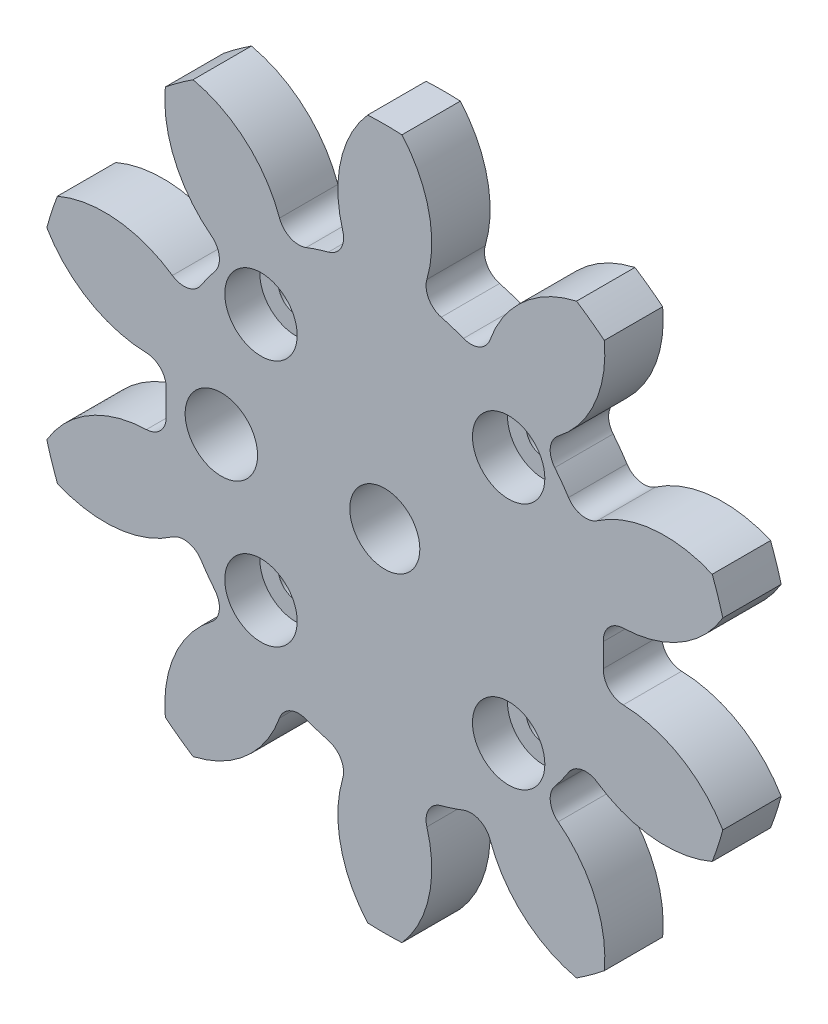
from build123d import *

# Parameters (mm, degrees)
BOSS_EXTRU_1_DEPTH                 = 5
CONG_1_R                           = 1.75
R_P_TITION_CIRCULAIRE4_COUNT       = 10
CONG_1_OF_R_P_TITION_CIRCULAIRE4_R = 1.75
ESQUISSE6_R                        = 3
ENL_V_MAT_EXTRU_1_DEPTH            = 10
ESQUISSE8_R                        = 1.5
ESQUISSE8_R_2                      = 3.1
ENL_V_MAT_EXTRU_3_DEPTH            = 42.990234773
ESQUISSE9_R                        = 3.1
ENL_V_MAT_EXTRU_4_DEPTH            = 3


with BuildPart() as part:
    # Esquisse3 → Boss.-Extru.1 (new body)
    with BuildSketch(Plane.XY):
        with BuildLine():
            Line((-5.794068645, 17.832309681), (0, 0))
            Line((0, 0), (5.794068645, 17.832309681))
            ThreePointArc((5.794068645, 17.832309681), (4.357814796, 18.236555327), (2.893965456, 18.525319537))
            ThreePointArc((2.893965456, 18.525319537), (3.941898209, 24.464041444), (1.468694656, 29.964027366))
            ThreePointArc((1.468694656, 29.964027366), (0, 30), (-1.468694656, 29.964027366))
            ThreePointArc((-1.468694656, 29.964027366), (-3.941898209, 24.464041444), (-2.893965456, 18.525319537))
            ThreePointArc((-2.893965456, 18.525319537), (-4.357814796, 18.236555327), (-5.794068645, 17.832309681))
        make_face()
    boss_extru_1 = extrude(amount=BOSS_EXTRU_1_DEPTH)

    # Cong_1
    cong_1_edges = [part.edges().sort_by_distance(p)[0] for p in [
        (-2.893965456, 18.525319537, 2.5),
        (2.893965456, 18.525319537, 2.5),
    ]]
    fillet(cong_1_edges, radius=CONG_1_R)

    # R_p_tition circulaire4: Boss.-Extru.1 ×10 about axis
    r_p_tition_circulaire4_axis = Axis((0, 0, 0), (0, 0, 1))
    for i in range(1, R_P_TITION_CIRCULAIRE4_COUNT):
        add(boss_extru_1.rotate(r_p_tition_circulaire4_axis, i * 360 / R_P_TITION_CIRCULAIRE4_COUNT))

    # Cong_1 of R_p_tition circulaire4
    cong_1_of_r_p_tition_circulaire4_edges = [part.edges().sort_by_distance(p)[0] for p in [
        (-13.230176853, 13.286268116, 2.5),
        (-8.547642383, 16.688328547, 2.5),
        (-18.512910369, 2.972313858, 2.5),
        (-16.724341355, 8.476963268, 2.5),
        (-16.724341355, -8.476963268, 2.5),
        (-18.512910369, -2.972313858, 2.5),
        (-8.547642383, -16.688328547, 2.5),
        (-13.230176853, -13.286268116, 2.5),
        (2.893965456, -18.525319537, 2.5),
        (-2.893965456, -18.525319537, 2.5),
        (13.230176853, -13.286268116, 2.5),
        (8.547642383, -16.688328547, 2.5),
        (18.512910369, -2.972313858, 2.5),
        (16.724341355, -8.476963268, 2.5),
        (16.724341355, 8.476963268, 2.5),
        (18.512910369, 2.972313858, 2.5),
        (8.547642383, 16.688328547, 2.5),
        (13.230176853, 13.286268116, 2.5),
    ]]
    fillet(cong_1_of_r_p_tition_circulaire4_edges, radius=CONG_1_OF_R_P_TITION_CIRCULAIRE4_R)

    # Esquisse6 → Enl_v. mat.-Extru.1 (cut)
    with BuildSketch(Plane.XY.offset(5)):
        Circle(ESQUISSE6_R)
    extrude(amount=-ENL_V_MAT_EXTRU_1_DEPTH, mode=Mode.SUBTRACT)

    # Esquisse8 → Enl_v. mat.-Extru.3 (cut, through all)
    with BuildSketch(Plane.XY.offset(5)):
        with Locations((-10.606601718, 10.606601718)):
            Circle(ESQUISSE8_R)
        with Locations((10.606601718, -10.606601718)):
            Circle(ESQUISSE8_R)
        with Locations((-10.606601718, -10.606601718)):
            Circle(ESQUISSE8_R)
        with Locations(Location((10.606601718, 10.606601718, 0), (0, 0, 180))):
            Circle(ESQUISSE8_R)
        with Locations((-14, 0)):
            Circle(ESQUISSE8_R_2)
    extrude(amount=-ENL_V_MAT_EXTRU_3_DEPTH, mode=Mode.SUBTRACT)

    # Esquisse9 → Enl_v. mat.-Extru.4 (cut)
    with BuildSketch(Plane.XY.offset(5)):
        with Locations((-10.606601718, 10.606601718)):
            Circle(ESQUISSE9_R)
        with Locations((-10.606601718, -10.606601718)):
            Circle(ESQUISSE9_R)
        with Locations((10.606601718, -10.606601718)):
            Circle(ESQUISSE9_R)
        with Locations((10.606601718, 10.606601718)):
            Circle(ESQUISSE9_R)
    extrude(amount=-ENL_V_MAT_EXTRU_4_DEPTH, mode=Mode.SUBTRACT)


solid = part.part
